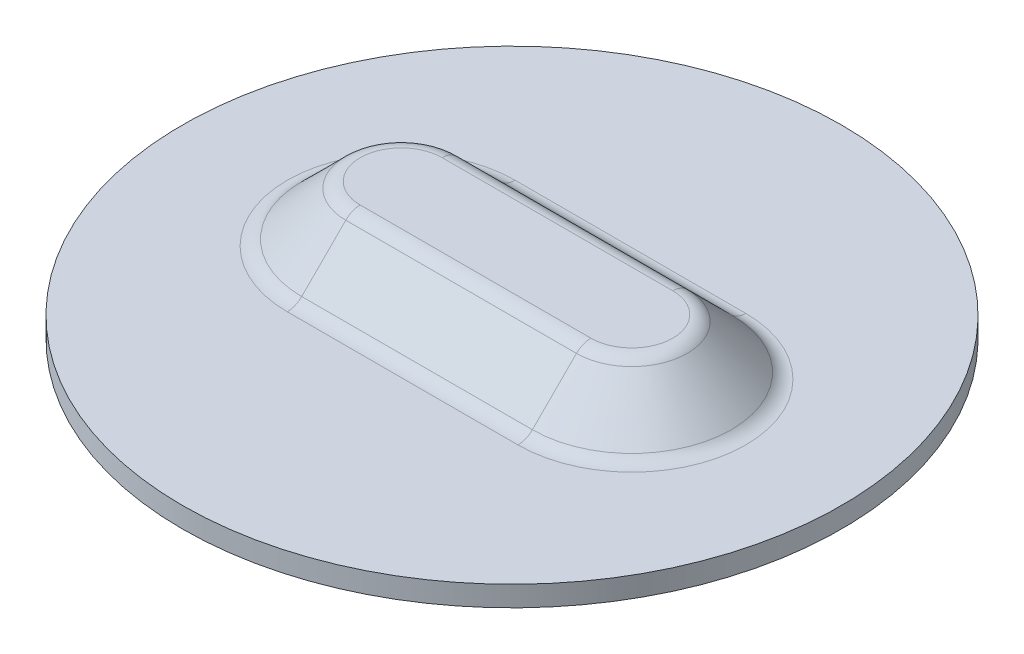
ISO-10303-21;
HEADER;
FILE_DESCRIPTION(('STEP AP214'),'2;1');
FILE_NAME('part.step','',(''),(''),'','','');
FILE_SCHEMA(('AUTOMOTIVE_DESIGN { 1 0 10303 214 1 1 1 1 }'));
ENDSEC;
DATA;
#1=APPLICATION_CONTEXT('core data for automotive mechanical design processes');
#2=APPLICATION_PROTOCOL_DEFINITION('international standard','automotive_design',2000,#1);
#3=PRODUCT_CONTEXT('',#1,'mechanical');
#4=PRODUCT('Part','Part','',(#3));
#5=PRODUCT_RELATED_PRODUCT_CATEGORY('part','',(#4));
#6=PRODUCT_DEFINITION_FORMATION('','',#4);
#7=PRODUCT_DEFINITION_CONTEXT('part definition',#1,'design');
#8=PRODUCT_DEFINITION('design','',#6,#7);
#9=PRODUCT_DEFINITION_SHAPE('','',#8);
#10=(LENGTH_UNIT() NAMED_UNIT(*) SI_UNIT(.MILLI.,.METRE.));
#11=(NAMED_UNIT(*) PLANE_ANGLE_UNIT() SI_UNIT($,.RADIAN.));
#12=(NAMED_UNIT(*) SI_UNIT($,.STERADIAN.) SOLID_ANGLE_UNIT());
#13=UNCERTAINTY_MEASURE_WITH_UNIT(LENGTH_MEASURE(1.E-05),#10,'distance_accuracy_value','');
#14=(GEOMETRIC_REPRESENTATION_CONTEXT(3) GLOBAL_UNCERTAINTY_ASSIGNED_CONTEXT((#13)) GLOBAL_UNIT_ASSIGNED_CONTEXT((#10,
#11,#12)) REPRESENTATION_CONTEXT('',''));
#15=CARTESIAN_POINT('',(0.,0.,0.));
#16=DIRECTION('',(0.,0.,1.));
#17=DIRECTION('',(1.,0.,0.));
#18=AXIS2_PLACEMENT_3D('',#15,#16,#17);
#19=CARTESIAN_POINT('',(-8.89,0.,-0.348010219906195));
#20=DIRECTION('',(0.,1.,0.));
#21=DIRECTION('',(0.,0.,1.));
#22=AXIS2_PLACEMENT_3D('',#19,#20,#21);
#23=PLANE('',#22);
#24=CARTESIAN_POINT('',(8.89,0.,-0.348010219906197));
#25=DIRECTION('',(0.,-1.,0.));
#26=DIRECTION('',(0.,0.,-1.));
#27=AXIS2_PLACEMENT_3D('',#24,#25,#26);
#28=CIRCLE('',#27,3.15769648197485);
#29=CARTESIAN_POINT('',(8.89,0.,-3.50570670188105));
#30=VERTEX_POINT('',#29);
#31=CARTESIAN_POINT('',(8.89,0.,2.80968626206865));
#32=VERTEX_POINT('',#31);
#33=EDGE_CURVE('E306',#30,#32,#28,.T.);
#34=ORIENTED_EDGE('',*,*,#33,.F.);
#35=DIRECTION('',(-1.,0.,0.));
#36=VECTOR('',#35,1.);
#37=CARTESIAN_POINT('',(-8.89,0.,-3.50570670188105));
#38=LINE('',#37,#36);
#39=CARTESIAN_POINT('',(-8.89,0.,-3.50570670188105));
#40=VERTEX_POINT('',#39);
#41=EDGE_CURVE('E292',#40,#30,#38,.F.);
#42=ORIENTED_EDGE('',*,*,#41,.F.);
#43=CARTESIAN_POINT('',(-8.89,0.,-0.348010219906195));
#44=DIRECTION('',(0.,-1.,0.));
#45=DIRECTION('',(0.,0.,1.));
#46=AXIS2_PLACEMENT_3D('',#43,#44,#45);
#47=CIRCLE('',#46,3.15769648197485);
#48=CARTESIAN_POINT('',(-8.89,0.,2.80968626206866));
#49=VERTEX_POINT('',#48);
#50=EDGE_CURVE('E259',#49,#40,#47,.T.);
#51=ORIENTED_EDGE('',*,*,#50,.F.);
#52=DIRECTION('',(1.,0.,0.));
#53=VECTOR('',#52,1.);
#54=CARTESIAN_POINT('',(-8.89,0.,2.80968626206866));
#55=LINE('',#54,#53);
#56=EDGE_CURVE('E264',#32,#49,#55,.F.);
#57=ORIENTED_EDGE('',*,*,#56,.F.);
#58=EDGE_LOOP('',(#34,#42,#51,#57));
#59=FACE_BOUND('',#58,.T.);
#60=ADVANCED_FACE('F18',(#59),#23,.T.);
#61=CARTESIAN_POINT('',(8.89,-1.5748,-0.348010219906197));
#62=DIRECTION('',(0.,1.,0.));
#63=DIRECTION('',(0.,0.,1.));
#64=AXIS2_PLACEMENT_3D('',#61,#62,#63);
#65=TOROIDAL_SURFACE('',#64,3.15769648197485,1.5748);
#66=CARTESIAN_POINT('',(8.89,-1.5748,2.80968626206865));
#67=DIRECTION('',(1.,0.,0.));
#68=DIRECTION('',(0.,0.,-1.));
#69=AXIS2_PLACEMENT_3D('',#66,#67,#68);
#70=CIRCLE('',#69,1.5748);
#71=CARTESIAN_POINT('',(8.89,-0.461248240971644,3.92323802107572));
#72=VERTEX_POINT('',#71);
#73=EDGE_CURVE('E258',#72,#32,#70,.F.);
#74=ORIENTED_EDGE('',*,*,#73,.F.);
#75=CARTESIAN_POINT('',(8.89,-0.461248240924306,-0.348010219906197));
#76=DIRECTION('',(0.,-1.,0.));
#77=DIRECTION('',(0.,0.,1.));
#78=AXIS2_PLACEMENT_3D('',#75,#76,#77);
#79=CIRCLE('',#78,4.2712482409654);
#80=CARTESIAN_POINT('',(8.89,-0.461248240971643,-4.61925846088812));
#81=VERTEX_POINT('',#80);
#82=EDGE_CURVE('E244',#81,#72,#79,.T.);
#83=ORIENTED_EDGE('',*,*,#82,.F.);
#84=CARTESIAN_POINT('',(8.89,-1.5748,-3.50570670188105));
#85=DIRECTION('',(-1.,0.,0.));
#86=DIRECTION('',(0.,0.,1.));
#87=AXIS2_PLACEMENT_3D('',#84,#85,#86);
#88=CIRCLE('',#87,1.5748);
#89=EDGE_CURVE('E300',#30,#81,#88,.T.);
#90=ORIENTED_EDGE('',*,*,#89,.F.);
#91=ORIENTED_EDGE('',*,*,#33,.T.);
#92=EDGE_LOOP('',(#74,#83,#90,#91));
#93=FACE_BOUND('',#92,.T.);
#94=ADVANCED_FACE('F311',(#93),#65,.T.);
#95=CARTESIAN_POINT('',(-8.89,-1.5748,-3.50570670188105));
#96=DIRECTION('',(-1.,0.,0.));
#97=DIRECTION('',(0.,0.,1.));
#98=AXIS2_PLACEMENT_3D('',#95,#96,#97);
#99=CYLINDRICAL_SURFACE('',#98,1.5748);
#100=CARTESIAN_POINT('',(-8.89,-1.5748,-3.50570670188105));
#101=DIRECTION('',(-1.,0.,0.));
#102=DIRECTION('',(0.,0.,-1.));
#103=AXIS2_PLACEMENT_3D('',#100,#101,#102);
#104=CIRCLE('',#103,1.5748);
#105=CARTESIAN_POINT('',(-8.89,-0.461248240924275,-4.6192584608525));
#106=VERTEX_POINT('',#105);
#107=EDGE_CURVE('E273',#40,#106,#104,.T.);
#108=ORIENTED_EDGE('',*,*,#107,.F.);
#109=ORIENTED_EDGE('',*,*,#41,.T.);
#110=ORIENTED_EDGE('',*,*,#89,.T.);
#111=DIRECTION('',(1.,0.,0.));
#112=VECTOR('',#111,1.);
#113=CARTESIAN_POINT('',(-8.89,-0.461248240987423,-4.61925846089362));
#114=LINE('',#113,#112);
#115=EDGE_CURVE('E238',#106,#81,#114,.T.);
#116=ORIENTED_EDGE('',*,*,#115,.F.);
#117=EDGE_LOOP('',(#108,#109,#110,#116));
#118=FACE_BOUND('',#117,.T.);
#119=ADVANCED_FACE('F282',(#118),#99,.T.);
#120=CARTESIAN_POINT('',(-8.89,-1.5748,-0.348010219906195));
#121=DIRECTION('',(0.,1.,0.));
#122=DIRECTION('',(0.,0.,1.));
#123=AXIS2_PLACEMENT_3D('',#120,#121,#122);
#124=TOROIDAL_SURFACE('',#123,3.15769648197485,1.5748);
#125=CARTESIAN_POINT('',(-8.89,-1.5748,2.80968626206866));
#126=DIRECTION('',(1.,0.,0.));
#127=DIRECTION('',(0.,0.,-1.));
#128=AXIS2_PLACEMENT_3D('',#125,#126,#127);
#129=CIRCLE('',#128,1.5748);
#130=CARTESIAN_POINT('',(-8.89,-0.461248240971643,3.92323802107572));
#131=VERTEX_POINT('',#130);
#132=EDGE_CURVE('E255',#49,#131,#129,.T.);
#133=ORIENTED_EDGE('',*,*,#132,.F.);
#134=ORIENTED_EDGE('',*,*,#50,.T.);
#135=ORIENTED_EDGE('',*,*,#107,.T.);
#136=CARTESIAN_POINT('',(-8.89,-0.461248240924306,-0.348010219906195));
#137=DIRECTION('',(0.,-1.,0.));
#138=DIRECTION('',(0.,0.,1.));
#139=AXIS2_PLACEMENT_3D('',#136,#137,#138);
#140=CIRCLE('',#139,4.2712482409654);
#141=EDGE_CURVE('E222',#131,#106,#140,.T.);
#142=ORIENTED_EDGE('',*,*,#141,.F.);
#143=EDGE_LOOP('',(#133,#134,#135,#142));
#144=FACE_BOUND('',#143,.T.);
#145=ADVANCED_FACE('F276',(#144),#124,.T.);
#146=CARTESIAN_POINT('',(-8.89,-1.5748,2.80968626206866));
#147=DIRECTION('',(1.,0.,0.));
#148=DIRECTION('',(0.,0.,-1.));
#149=AXIS2_PLACEMENT_3D('',#146,#147,#148);
#150=CYLINDRICAL_SURFACE('',#149,1.5748);
#151=ORIENTED_EDGE('',*,*,#73,.T.);
#152=ORIENTED_EDGE('',*,*,#56,.T.);
#153=ORIENTED_EDGE('',*,*,#132,.T.);
#154=DIRECTION('',(1.,0.,0.));
#155=VECTOR('',#154,1.);
#156=CARTESIAN_POINT('',(-8.89,-0.461248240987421,3.92323802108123));
#157=LINE('',#156,#155);
#158=EDGE_CURVE('E221',#72,#131,#157,.F.);
#159=ORIENTED_EDGE('',*,*,#158,.F.);
#160=EDGE_LOOP('',(#151,#152,#153,#159));
#161=FACE_BOUND('',#160,.T.);
#162=ADVANCED_FACE('F281',(#161),#150,.T.);
#163=CARTESIAN_POINT('',(8.89,-3.85675175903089,-0.348010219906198));
#164=DIRECTION('',(0.,-1.,0.));
#165=DIRECTION('',(1.,0.,0.));
#166=AXIS2_PLACEMENT_3D('',#163,#164,#165);
#167=CONICAL_SURFACE('',#166,7.66675175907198,0.785398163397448);
#168=DIRECTION('',(0.,0.707106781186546,0.707106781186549));
#169=VECTOR('',#168,1.);
#170=CARTESIAN_POINT('',(8.89,0.,-4.1580102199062));
#171=LINE('',#170,#169);
#172=CARTESIAN_POINT('',(8.89,-3.85675175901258,-8.01476197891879));
#173=VERTEX_POINT('',#172);
#174=EDGE_CURVE('E241',#81,#173,#171,.F.);
#175=ORIENTED_EDGE('',*,*,#174,.F.);
#176=ORIENTED_EDGE('',*,*,#82,.T.);
#177=DIRECTION('',(0.,-0.707106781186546,0.707106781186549));
#178=VECTOR('',#177,1.);
#179=CARTESIAN_POINT('',(8.89,0.,3.46198978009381));
#180=LINE('',#179,#178);
#181=CARTESIAN_POINT('',(8.89,-3.85675175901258,7.3187415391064));
#182=VERTEX_POINT('',#181);
#183=EDGE_CURVE('E218',#182,#72,#180,.F.);
#184=ORIENTED_EDGE('',*,*,#183,.F.);
#185=CARTESIAN_POINT('',(8.89,-3.85675175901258,-0.348010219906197));
#186=DIRECTION('',(0.,-1.,0.));
#187=DIRECTION('',(0.,0.,-1.));
#188=AXIS2_PLACEMENT_3D('',#185,#186,#187);
#189=CIRCLE('',#188,7.66675175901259);
#190=EDGE_CURVE('E209',#182,#173,#189,.F.);
#191=ORIENTED_EDGE('',*,*,#190,.T.);
#192=EDGE_LOOP('',(#175,#176,#184,#191));
#193=FACE_BOUND('',#192,.T.);
#194=ADVANCED_FACE('F648',(#193),#167,.T.);
#195=CARTESIAN_POINT('',(-8.89,0.,-4.1580102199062));
#196=DIRECTION('',(0.,0.707106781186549,-0.707106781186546));
#197=DIRECTION('',(0.,0.707106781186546,0.707106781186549));
#198=AXIS2_PLACEMENT_3D('',#195,#196,#197);
#199=PLANE('',#198);
#200=DIRECTION('',(0.,0.707106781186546,0.707106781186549));
#201=VECTOR('',#200,1.);
#202=CARTESIAN_POINT('',(-8.89000000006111,-498996.538010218,-499000.69602044));
#203=LINE('',#202,#201);
#204=CARTESIAN_POINT('',(-8.89,-3.85675175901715,-8.01476197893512));
#205=VERTEX_POINT('',#204);
#206=EDGE_CURVE('E235',#106,#205,#203,.F.);
#207=ORIENTED_EDGE('',*,*,#206,.F.);
#208=ORIENTED_EDGE('',*,*,#115,.T.);
#209=ORIENTED_EDGE('',*,*,#174,.T.);
#210=DIRECTION('',(-1.,0.,0.));
#211=VECTOR('',#210,1.);
#212=CARTESIAN_POINT('',(-8.89,-3.85675175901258,-8.01476197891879));
#213=LINE('',#212,#211);
#214=EDGE_CURVE('E189',#173,#205,#213,.T.);
#215=ORIENTED_EDGE('',*,*,#214,.T.);
#216=EDGE_LOOP('',(#207,#208,#209,#215));
#217=FACE_BOUND('',#216,.T.);
#218=ADVANCED_FACE('F639',(#217),#199,.T.);
#219=CARTESIAN_POINT('',(-8.89,-3.85675175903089,-0.348010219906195));
#220=DIRECTION('',(0.,-1.,0.));
#221=DIRECTION('',(1.,0.,0.));
#222=AXIS2_PLACEMENT_3D('',#219,#220,#221);
#223=CONICAL_SURFACE('',#222,7.66675175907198,0.785398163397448);
#224=DIRECTION('',(0.,-0.707106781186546,0.707106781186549));
#225=VECTOR('',#224,1.);
#226=CARTESIAN_POINT('',(-8.89,0.,3.46198978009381));
#227=LINE('',#226,#225);
#228=CARTESIAN_POINT('',(-8.89,-3.85675175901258,7.3187415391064));
#229=VERTEX_POINT('',#228);
#230=EDGE_CURVE('E211',#131,#229,#227,.T.);
#231=ORIENTED_EDGE('',*,*,#230,.F.);
#232=ORIENTED_EDGE('',*,*,#141,.T.);
#233=ORIENTED_EDGE('',*,*,#206,.T.);
#234=CARTESIAN_POINT('',(-8.89,-3.85675175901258,-0.348010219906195));
#235=DIRECTION('',(0.,-1.,0.));
#236=DIRECTION('',(0.,0.,-1.));
#237=AXIS2_PLACEMENT_3D('',#234,#235,#236);
#238=CIRCLE('',#237,7.66675175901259);
#239=EDGE_CURVE('E183',#205,#229,#238,.F.);
#240=ORIENTED_EDGE('',*,*,#239,.T.);
#241=EDGE_LOOP('',(#231,#232,#233,#240));
#242=FACE_BOUND('',#241,.T.);
#243=ADVANCED_FACE('F631',(#242),#223,.T.);
#244=CARTESIAN_POINT('',(-8.89,0.,3.46198978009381));
#245=DIRECTION('',(0.,0.707106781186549,0.707106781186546));
#246=DIRECTION('',(0.,-0.707106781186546,0.707106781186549));
#247=AXIS2_PLACEMENT_3D('',#244,#245,#246);
#248=PLANE('',#247);
#249=ORIENTED_EDGE('',*,*,#230,.T.);
#250=DIRECTION('',(1.,0.,0.));
#251=VECTOR('',#250,1.);
#252=CARTESIAN_POINT('',(-8.89,-3.85675175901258,7.3187415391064));
#253=LINE('',#252,#251);
#254=EDGE_CURVE('E152',#229,#182,#253,.T.);
#255=ORIENTED_EDGE('',*,*,#254,.T.);
#256=ORIENTED_EDGE('',*,*,#183,.T.);
#257=ORIENTED_EDGE('',*,*,#158,.T.);
#258=EDGE_LOOP('',(#249,#255,#256,#257));
#259=FACE_BOUND('',#258,.T.);
#260=ADVANCED_FACE('F624',(#259),#248,.T.);
#261=CARTESIAN_POINT('',(-8.89,-1.5748,-0.348010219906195));
#262=DIRECTION('',(0.,1.,0.));
#263=DIRECTION('',(0.,0.,1.));
#264=AXIS2_PLACEMENT_3D('',#261,#262,#263);
#265=PLANE('',#264);
#266=DIRECTION('',(1.,0.,0.));
#267=VECTOR('',#266,1.);
#268=CARTESIAN_POINT('',(-8.89,-1.5748,-3.50570670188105));
#269=LINE('',#268,#267);
#270=CARTESIAN_POINT('',(-8.89,-1.57480000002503,-3.50570670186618));
#271=VERTEX_POINT('',#270);
#272=CARTESIAN_POINT('',(8.89,-1.57480000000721,-3.50570670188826));
#273=VERTEX_POINT('',#272);
#274=EDGE_CURVE('E117',#271,#273,#269,.T.);
#275=ORIENTED_EDGE('',*,*,#274,.T.);
#276=CARTESIAN_POINT('',(8.89,-1.57480000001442,-0.348010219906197));
#277=DIRECTION('',(0.,-1.,0.));
#278=DIRECTION('',(0.,0.,-1.));
#279=AXIS2_PLACEMENT_3D('',#276,#277,#278);
#280=CIRCLE('',#279,3.15769648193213);
#281=CARTESIAN_POINT('',(8.89,-1.57480000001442,2.80968626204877));
#282=VERTEX_POINT('',#281);
#283=EDGE_CURVE('E22',#273,#282,#280,.T.);
#284=ORIENTED_EDGE('',*,*,#283,.T.);
#285=DIRECTION('',(1.,0.,0.));
#286=VECTOR('',#285,1.);
#287=CARTESIAN_POINT('',(-8.89,-1.5748,2.80968626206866));
#288=LINE('',#287,#286);
#289=CARTESIAN_POINT('',(-8.89,-1.57480000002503,2.80968626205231));
#290=VERTEX_POINT('',#289);
#291=EDGE_CURVE('E121',#282,#290,#288,.F.);
#292=ORIENTED_EDGE('',*,*,#291,.T.);
#293=CARTESIAN_POINT('',(-8.89,-1.57480000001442,-0.348010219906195));
#294=DIRECTION('',(0.,-1.,0.));
#295=DIRECTION('',(0.,0.,-1.));
#296=AXIS2_PLACEMENT_3D('',#293,#294,#295);
#297=CIRCLE('',#296,3.15769648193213);
#298=EDGE_CURVE('E503',#290,#271,#297,.T.);
#299=ORIENTED_EDGE('',*,*,#298,.T.);
#300=EDGE_LOOP('',(#275,#284,#292,#299));
#301=FACE_BOUND('',#300,.T.);
#302=ADVANCED_FACE('F120',(#301),#265,.F.);
#303=CARTESIAN_POINT('',(8.89,-2.7432,-0.348010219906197));
#304=DIRECTION('',(0.,-1.,0.));
#305=DIRECTION('',(0.,0.,-1.));
#306=AXIS2_PLACEMENT_3D('',#303,#304,#305);
#307=TOROIDAL_SURFACE('',#306,8.78030351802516,1.5748);
#308=CARTESIAN_POINT('',(8.89,-4.318,-0.348010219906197));
#309=DIRECTION('',(0.,1.,0.));
#310=DIRECTION('',(0.,0.,1.));
#311=AXIS2_PLACEMENT_3D('',#308,#309,#310);
#312=CIRCLE('',#311,8.78030351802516);
#313=CARTESIAN_POINT('',(8.89,-4.318,8.43229329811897));
#314=VERTEX_POINT('',#313);
#315=CARTESIAN_POINT('',(8.89,-4.318,-9.12831373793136));
#316=VERTEX_POINT('',#315);
#317=EDGE_CURVE('E458',#314,#316,#312,.T.);
#318=ORIENTED_EDGE('',*,*,#317,.T.);
#319=CARTESIAN_POINT('',(8.89,-2.7432,-9.12831373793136));
#320=DIRECTION('',(-1.,0.,0.));
#321=DIRECTION('',(0.,0.,1.));
#322=AXIS2_PLACEMENT_3D('',#319,#320,#321);
#323=CIRCLE('',#322,1.5748);
#324=EDGE_CURVE('E186',#316,#173,#323,.T.);
#325=ORIENTED_EDGE('',*,*,#324,.T.);
#326=ORIENTED_EDGE('',*,*,#190,.F.);
#327=CARTESIAN_POINT('',(8.89,-2.7432,8.43229329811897));
#328=DIRECTION('',(1.,0.,0.));
#329=DIRECTION('',(0.,0.,-1.));
#330=AXIS2_PLACEMENT_3D('',#327,#328,#329);
#331=CIRCLE('',#330,1.5748);
#332=EDGE_CURVE('E133',#182,#314,#331,.F.);
#333=ORIENTED_EDGE('',*,*,#332,.T.);
#334=EDGE_LOOP('',(#318,#325,#326,#333));
#335=FACE_BOUND('',#334,.T.);
#336=ADVANCED_FACE('F195',(#335),#307,.F.);
#337=CARTESIAN_POINT('',(-8.89,-2.7432,-9.12831373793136));
#338=DIRECTION('',(-1.,0.,0.));
#339=DIRECTION('',(0.,0.,1.));
#340=AXIS2_PLACEMENT_3D('',#337,#338,#339);
#341=CYLINDRICAL_SURFACE('',#340,1.5748);
#342=DIRECTION('',(1.,0.,0.));
#343=VECTOR('',#342,1.);
#344=CARTESIAN_POINT('',(0.,-4.318,-9.12831373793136));
#345=LINE('',#344,#343);
#346=CARTESIAN_POINT('',(-8.89,-4.318,-9.12831373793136));
#347=VERTEX_POINT('',#346);
#348=EDGE_CURVE('E491',#316,#347,#345,.F.);
#349=ORIENTED_EDGE('',*,*,#348,.T.);
#350=CARTESIAN_POINT('',(-8.89,-2.7432,-9.12831373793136));
#351=DIRECTION('',(1.,0.,0.));
#352=DIRECTION('',(0.,0.,-1.));
#353=AXIS2_PLACEMENT_3D('',#350,#351,#352);
#354=CIRCLE('',#353,1.5748);
#355=EDGE_CURVE('E153',#347,#205,#354,.F.);
#356=ORIENTED_EDGE('',*,*,#355,.T.);
#357=ORIENTED_EDGE('',*,*,#214,.F.);
#358=ORIENTED_EDGE('',*,*,#324,.F.);
#359=EDGE_LOOP('',(#349,#356,#357,#358));
#360=FACE_BOUND('',#359,.T.);
#361=ADVANCED_FACE('F169',(#360),#341,.F.);
#362=CARTESIAN_POINT('',(-8.89,-2.7432,-0.348010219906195));
#363=DIRECTION('',(0.,-1.,0.));
#364=DIRECTION('',(0.,0.,-1.));
#365=AXIS2_PLACEMENT_3D('',#362,#363,#364);
#366=TOROIDAL_SURFACE('',#365,8.78030351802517,1.5748);
#367=CARTESIAN_POINT('',(-8.89,-4.318,-0.348010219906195));
#368=DIRECTION('',(0.,1.,0.));
#369=DIRECTION('',(0.,0.,-1.));
#370=AXIS2_PLACEMENT_3D('',#367,#368,#369);
#371=CIRCLE('',#370,8.78030351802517);
#372=CARTESIAN_POINT('',(-8.89,-4.318,8.43229329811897));
#373=VERTEX_POINT('',#372);
#374=EDGE_CURVE('E488',#347,#373,#371,.T.);
#375=ORIENTED_EDGE('',*,*,#374,.T.);
#376=CARTESIAN_POINT('',(-8.89,-2.7432,8.43229329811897));
#377=DIRECTION('',(1.,0.,0.));
#378=DIRECTION('',(0.,0.,-1.));
#379=AXIS2_PLACEMENT_3D('',#376,#377,#378);
#380=CIRCLE('',#379,1.5748);
#381=EDGE_CURVE('E149',#373,#229,#380,.T.);
#382=ORIENTED_EDGE('',*,*,#381,.T.);
#383=ORIENTED_EDGE('',*,*,#239,.F.);
#384=ORIENTED_EDGE('',*,*,#355,.F.);
#385=EDGE_LOOP('',(#375,#382,#383,#384));
#386=FACE_BOUND('',#385,.T.);
#387=ADVANCED_FACE('F163',(#386),#366,.F.);
#388=CARTESIAN_POINT('',(-8.89,-2.7432,8.43229329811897));
#389=DIRECTION('',(1.,0.,0.));
#390=DIRECTION('',(0.,0.,-1.));
#391=AXIS2_PLACEMENT_3D('',#388,#389,#390);
#392=CYLINDRICAL_SURFACE('',#391,1.5748);
#393=ORIENTED_EDGE('',*,*,#254,.F.);
#394=ORIENTED_EDGE('',*,*,#381,.F.);
#395=DIRECTION('',(1.,0.,0.));
#396=VECTOR('',#395,1.);
#397=CARTESIAN_POINT('',(0.,-4.318,8.43229329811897));
#398=LINE('',#397,#396);
#399=EDGE_CURVE('E480',#373,#314,#398,.T.);
#400=ORIENTED_EDGE('',*,*,#399,.T.);
#401=ORIENTED_EDGE('',*,*,#332,.F.);
#402=EDGE_LOOP('',(#393,#394,#400,#401));
#403=FACE_BOUND('',#402,.T.);
#404=ADVANCED_FACE('F168',(#403),#392,.F.);
#405=CARTESIAN_POINT('',(-8.89,-1.11355175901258,2.34843802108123));
#406=DIRECTION('',(0.,0.707106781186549,0.707106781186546));
#407=DIRECTION('',(0.,-0.707106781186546,0.707106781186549));
#408=AXIS2_PLACEMENT_3D('',#405,#406,#407);
#409=PLANE('',#408);
#410=DIRECTION('',(1.,0.,0.));
#411=VECTOR('',#410,1.);
#412=CARTESIAN_POINT('',(-8.89,-4.97030351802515,6.20518978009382));
#413=LINE('',#412,#411);
#414=CARTESIAN_POINT('',(-8.89,-4.97030351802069,6.20518978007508));
#415=VERTEX_POINT('',#414);
#416=CARTESIAN_POINT('',(8.89,-4.97030351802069,6.20518978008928));
#417=VERTEX_POINT('',#416);
#418=EDGE_CURVE('E450',#415,#417,#413,.T.);
#419=ORIENTED_EDGE('',*,*,#418,.F.);
#420=DIRECTION('',(0.,0.707106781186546,-0.707106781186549));
#421=VECTOR('',#420,1.);
#422=CARTESIAN_POINT('',(-8.89,-498998.765113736,499000.));
#423=LINE('',#422,#421);
#424=EDGE_CURVE('E131',#415,#290,#423,.T.);
#425=ORIENTED_EDGE('',*,*,#424,.T.);
#426=ORIENTED_EDGE('',*,*,#291,.F.);
#427=DIRECTION('',(0.,0.707106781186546,-0.707106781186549));
#428=VECTOR('',#427,1.);
#429=CARTESIAN_POINT('',(8.89,-498998.765113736,499000.));
#430=LINE('',#429,#428);
#431=EDGE_CURVE('E126',#282,#417,#430,.F.);
#432=ORIENTED_EDGE('',*,*,#431,.T.);
#433=EDGE_LOOP('',(#419,#425,#426,#432));
#434=FACE_BOUND('',#433,.T.);
#435=ADVANCED_FACE('F128',(#434),#409,.F.);
#436=CARTESIAN_POINT('',(8.89,-4.97030351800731,-0.348010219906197));
#437=DIRECTION('',(0.,-1.,0.));
#438=DIRECTION('',(0.,0.,-1.));
#439=AXIS2_PLACEMENT_3D('',#436,#437,#438);
#440=CONICAL_SURFACE('',#439,6.55319999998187,0.785398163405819);
#441=ORIENTED_EDGE('',*,*,#283,.F.);
#442=DIRECTION('',(0.,0.707106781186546,0.707106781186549));
#443=VECTOR('',#442,1.);
#444=CARTESIAN_POINT('',(8.89,-1.11355175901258,-3.04445846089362));
#445=LINE('',#444,#443);
#446=CARTESIAN_POINT('',(8.89,-4.97030351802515,-6.90121021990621));
#447=VERTEX_POINT('',#446);
#448=EDGE_CURVE('E141',#273,#447,#445,.F.);
#449=ORIENTED_EDGE('',*,*,#448,.T.);
#450=CARTESIAN_POINT('',(8.89,-4.97030351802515,-0.348010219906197));
#451=DIRECTION('',(0.,-1.,0.));
#452=DIRECTION('',(0.,0.,-1.));
#453=AXIS2_PLACEMENT_3D('',#450,#451,#452);
#454=CIRCLE('',#453,6.55320000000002);
#455=EDGE_CURVE('E138',#417,#447,#454,.F.);
#456=ORIENTED_EDGE('',*,*,#455,.F.);
#457=ORIENTED_EDGE('',*,*,#431,.F.);
#458=EDGE_LOOP('',(#441,#449,#456,#457));
#459=FACE_BOUND('',#458,.T.);
#460=ADVANCED_FACE('F136',(#459),#440,.F.);
#461=CARTESIAN_POINT('',(-8.89,-1.11355175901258,-3.04445846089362));
#462=DIRECTION('',(0.,0.707106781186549,-0.707106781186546));
#463=DIRECTION('',(0.,0.707106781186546,0.707106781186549));
#464=AXIS2_PLACEMENT_3D('',#461,#462,#463);
#465=PLANE('',#464);
#466=ORIENTED_EDGE('',*,*,#274,.F.);
#467=DIRECTION('',(0.,0.707106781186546,0.707106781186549));
#468=VECTOR('',#467,1.);
#469=CARTESIAN_POINT('',(-8.89000000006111,-498998.765113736,-499000.69602044));
#470=LINE('',#469,#468);
#471=CARTESIAN_POINT('',(-8.89,-4.97030351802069,-6.90121021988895));
#472=VERTEX_POINT('',#471);
#473=EDGE_CURVE('E506',#271,#472,#470,.F.);
#474=ORIENTED_EDGE('',*,*,#473,.T.);
#475=DIRECTION('',(-1.,0.,0.));
#476=VECTOR('',#475,1.);
#477=CARTESIAN_POINT('',(-8.89,-4.97030351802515,-6.90121021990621));
#478=LINE('',#477,#476);
#479=EDGE_CURVE('E421',#447,#472,#478,.T.);
#480=ORIENTED_EDGE('',*,*,#479,.F.);
#481=ORIENTED_EDGE('',*,*,#448,.F.);
#482=EDGE_LOOP('',(#466,#474,#480,#481));
#483=FACE_BOUND('',#482,.T.);
#484=ADVANCED_FACE('F517',(#483),#465,.F.);
#485=CARTESIAN_POINT('',(-8.89,-4.97030351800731,-0.348010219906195));
#486=DIRECTION('',(0.,-1.,0.));
#487=DIRECTION('',(0.,0.,-1.));
#488=AXIS2_PLACEMENT_3D('',#485,#486,#487);
#489=CONICAL_SURFACE('',#488,6.55319999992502,0.785398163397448);
#490=ORIENTED_EDGE('',*,*,#298,.F.);
#491=ORIENTED_EDGE('',*,*,#424,.F.);
#492=CARTESIAN_POINT('',(-8.89,-4.97030351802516,-0.348010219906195));
#493=DIRECTION('',(0.,-1.,0.));
#494=DIRECTION('',(0.,0.,-1.));
#495=AXIS2_PLACEMENT_3D('',#492,#493,#494);
#496=CIRCLE('',#495,6.55320000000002);
#497=EDGE_CURVE('E417',#472,#415,#496,.F.);
#498=ORIENTED_EDGE('',*,*,#497,.F.);
#499=ORIENTED_EDGE('',*,*,#473,.F.);
#500=EDGE_LOOP('',(#490,#491,#498,#499));
#501=FACE_BOUND('',#500,.T.);
#502=ADVANCED_FACE('F473',(#501),#489,.F.);
#503=CARTESIAN_POINT('',(0.,-4.318,0.));
#504=DIRECTION('',(0.,-1.,0.));
#505=DIRECTION('',(0.,0.,-1.));
#506=AXIS2_PLACEMENT_3D('',#503,#504,#505);
#507=PLANE('',#506);
#508=CARTESIAN_POINT('',(0.,-4.318,0.));
#509=DIRECTION('',(0.,-1.,0.));
#510=DIRECTION('',(0.,0.,-1.));
#511=AXIS2_PLACEMENT_3D('',#508,#509,#510);
#512=CIRCLE('',#511,25.4);
#513=CARTESIAN_POINT('',(0.,-4.318,-25.4));
#514=VERTEX_POINT('',#513);
#515=EDGE_CURVE('E397',#514,#514,#512,.T.);
#516=ORIENTED_EDGE('',*,*,#515,.F.);
#517=EDGE_LOOP('',(#516));
#518=FACE_BOUND('',#517,.T.);
#519=ORIENTED_EDGE('',*,*,#374,.F.);
#520=ORIENTED_EDGE('',*,*,#348,.F.);
#521=ORIENTED_EDGE('',*,*,#317,.F.);
#522=ORIENTED_EDGE('',*,*,#399,.F.);
#523=EDGE_LOOP('',(#519,#520,#521,#522));
#524=FACE_BOUND('',#523,.T.);
#525=ADVANCED_FACE('F464',(#518,#524),#507,.F.);
#526=CARTESIAN_POINT('',(-8.89,-2.7432,8.43229329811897));
#527=DIRECTION('',(1.,0.,0.));
#528=DIRECTION('',(0.,0.,-1.));
#529=AXIS2_PLACEMENT_3D('',#526,#527,#528);
#530=CYLINDRICAL_SURFACE('',#529,3.1496);
#531=CARTESIAN_POINT('',(-8.89,-2.7432,8.43229329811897));
#532=DIRECTION('',(-1.,0.,0.));
#533=DIRECTION('',(0.,0.,1.));
#534=AXIS2_PLACEMENT_3D('',#531,#532,#533);
#535=CIRCLE('',#534,3.1496);
#536=CARTESIAN_POINT('',(-8.89,-5.8928,8.43229329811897));
#537=VERTEX_POINT('',#536);
#538=EDGE_CURVE('E410',#415,#537,#535,.T.);
#539=ORIENTED_EDGE('',*,*,#538,.F.);
#540=ORIENTED_EDGE('',*,*,#418,.T.);
#541=CARTESIAN_POINT('',(8.89,-2.7432,8.43229329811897));
#542=DIRECTION('',(-1.,0.,0.));
#543=DIRECTION('',(0.,0.,1.));
#544=AXIS2_PLACEMENT_3D('',#541,#542,#543);
#545=CIRCLE('',#544,3.1496);
#546=CARTESIAN_POINT('',(8.89,-5.8928,8.43229329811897));
#547=VERTEX_POINT('',#546);
#548=EDGE_CURVE('E443',#547,#417,#545,.F.);
#549=ORIENTED_EDGE('',*,*,#548,.F.);
#550=DIRECTION('',(1.,0.,0.));
#551=VECTOR('',#550,1.);
#552=CARTESIAN_POINT('',(0.,-5.8928,8.43229329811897));
#553=LINE('',#552,#551);
#554=EDGE_CURVE('E387',#537,#547,#553,.T.);
#555=ORIENTED_EDGE('',*,*,#554,.F.);
#556=EDGE_LOOP('',(#539,#540,#549,#555));
#557=FACE_BOUND('',#556,.T.);
#558=ADVANCED_FACE('F437',(#557),#530,.T.);
#559=CARTESIAN_POINT('',(8.89,-2.7432,-0.348010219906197));
#560=DIRECTION('',(0.,-1.,0.));
#561=DIRECTION('',(0.,0.,-1.));
#562=AXIS2_PLACEMENT_3D('',#559,#560,#561);
#563=TOROIDAL_SURFACE('',#562,8.78030351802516,3.1496);
#564=CARTESIAN_POINT('',(8.89,-2.7432,-9.12831373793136));
#565=DIRECTION('',(-1.,0.,0.));
#566=DIRECTION('',(0.,0.,1.));
#567=AXIS2_PLACEMENT_3D('',#564,#565,#566);
#568=CIRCLE('',#567,3.1496);
#569=CARTESIAN_POINT('',(8.89,-5.8928,-9.12831373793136));
#570=VERTEX_POINT('',#569);
#571=EDGE_CURVE('E424',#570,#447,#568,.T.);
#572=ORIENTED_EDGE('',*,*,#571,.F.);
#573=CARTESIAN_POINT('',(8.89,-5.8928,-0.348010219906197));
#574=DIRECTION('',(0.,-1.,0.));
#575=DIRECTION('',(0.,0.,-1.));
#576=AXIS2_PLACEMENT_3D('',#573,#574,#575);
#577=CIRCLE('',#576,8.78030351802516);
#578=EDGE_CURVE('E392',#547,#570,#577,.F.);
#579=ORIENTED_EDGE('',*,*,#578,.F.);
#580=ORIENTED_EDGE('',*,*,#548,.T.);
#581=ORIENTED_EDGE('',*,*,#455,.T.);
#582=EDGE_LOOP('',(#572,#579,#580,#581));
#583=FACE_BOUND('',#582,.T.);
#584=ADVANCED_FACE('F433',(#583),#563,.T.);
#585=CARTESIAN_POINT('',(-8.89,-2.7432,-9.12831373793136));
#586=DIRECTION('',(-1.,0.,0.));
#587=DIRECTION('',(0.,0.,1.));
#588=AXIS2_PLACEMENT_3D('',#585,#586,#587);
#589=CYLINDRICAL_SURFACE('',#588,3.1496);
#590=CARTESIAN_POINT('',(-8.89,-2.7432,-9.12831373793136));
#591=DIRECTION('',(1.,0.,0.));
#592=DIRECTION('',(0.,0.,-1.));
#593=AXIS2_PLACEMENT_3D('',#590,#591,#592);
#594=CIRCLE('',#593,3.1496);
#595=CARTESIAN_POINT('',(-8.89,-5.8928,-9.12831373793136));
#596=VERTEX_POINT('',#595);
#597=EDGE_CURVE('E37',#596,#472,#594,.F.);
#598=ORIENTED_EDGE('',*,*,#597,.F.);
#599=DIRECTION('',(1.,0.,0.));
#600=VECTOR('',#599,1.);
#601=CARTESIAN_POINT('',(0.,-5.8928,-9.12831373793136));
#602=LINE('',#601,#600);
#603=EDGE_CURVE('E388',#570,#596,#602,.F.);
#604=ORIENTED_EDGE('',*,*,#603,.F.);
#605=ORIENTED_EDGE('',*,*,#571,.T.);
#606=ORIENTED_EDGE('',*,*,#479,.T.);
#607=EDGE_LOOP('',(#598,#604,#605,#606));
#608=FACE_BOUND('',#607,.T.);
#609=ADVANCED_FACE('F405',(#608),#589,.T.);
#610=CARTESIAN_POINT('',(-8.89,-2.7432,-0.348010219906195));
#611=DIRECTION('',(0.,-1.,0.));
#612=DIRECTION('',(0.,0.,-1.));
#613=AXIS2_PLACEMENT_3D('',#610,#611,#612);
#614=TOROIDAL_SURFACE('',#613,8.78030351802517,3.1496);
#615=ORIENTED_EDGE('',*,*,#538,.T.);
#616=CARTESIAN_POINT('',(-8.89,-5.8928,-0.348010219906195));
#617=DIRECTION('',(0.,-1.,0.));
#618=DIRECTION('',(0.,0.,1.));
#619=AXIS2_PLACEMENT_3D('',#616,#617,#618);
#620=CIRCLE('',#619,8.78030351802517);
#621=EDGE_CURVE('E28',#596,#537,#620,.F.);
#622=ORIENTED_EDGE('',*,*,#621,.F.);
#623=ORIENTED_EDGE('',*,*,#597,.T.);
#624=ORIENTED_EDGE('',*,*,#497,.T.);
#625=EDGE_LOOP('',(#615,#622,#623,#624));
#626=FACE_BOUND('',#625,.T.);
#627=ADVANCED_FACE('F361',(#626),#614,.T.);
#628=CARTESIAN_POINT('',(0.,-4.318,0.));
#629=DIRECTION('',(0.,-1.,0.));
#630=DIRECTION('',(0.,0.,-1.));
#631=AXIS2_PLACEMENT_3D('',#628,#629,#630);
#632=CYLINDRICAL_SURFACE('',#631,25.4);
#633=ORIENTED_EDGE('',*,*,#515,.T.);
#634=EDGE_LOOP('',(#633));
#635=FACE_BOUND('',#634,.T.);
#636=CARTESIAN_POINT('',(0.,-5.8928,0.));
#637=DIRECTION('',(0.,-1.,0.));
#638=DIRECTION('',(0.,0.,-1.));
#639=AXIS2_PLACEMENT_3D('',#636,#637,#638);
#640=CIRCLE('',#639,25.4);
#641=CARTESIAN_POINT('',(0.,-5.8928,-25.4));
#642=VERTEX_POINT('',#641);
#643=EDGE_CURVE('E11',#642,#642,#640,.T.);
#644=ORIENTED_EDGE('',*,*,#643,.F.);
#645=EDGE_LOOP('',(#644));
#646=FACE_BOUND('',#645,.T.);
#647=ADVANCED_FACE('F355',(#635,#646),#632,.T.);
#648=CARTESIAN_POINT('',(0.,-5.8928,0.));
#649=DIRECTION('',(0.,-1.,0.));
#650=DIRECTION('',(0.,0.,-1.));
#651=AXIS2_PLACEMENT_3D('',#648,#649,#650);
#652=PLANE('',#651);
#653=ORIENTED_EDGE('',*,*,#643,.T.);
#654=EDGE_LOOP('',(#653));
#655=FACE_BOUND('',#654,.T.);
#656=ORIENTED_EDGE('',*,*,#603,.T.);
#657=ORIENTED_EDGE('',*,*,#621,.T.);
#658=ORIENTED_EDGE('',*,*,#554,.T.);
#659=ORIENTED_EDGE('',*,*,#578,.T.);
#660=EDGE_LOOP('',(#656,#657,#658,#659));
#661=FACE_BOUND('',#660,.T.);
#662=ADVANCED_FACE('F353',(#655,#661),#652,.T.);
#663=CLOSED_SHELL('',(#60,#94,#119,#145,#162,#194,#218,#243,#260,#302,#336,#361,#387,#404,#435,
#460,#484,#502,#525,#558,#584,#609,#627,#647,#662));
#664=MANIFOLD_SOLID_BREP('B1',#663);
#665=ADVANCED_BREP_SHAPE_REPRESENTATION('',(#18,#664),#14);
#666=SHAPE_DEFINITION_REPRESENTATION(#9,#665);
ENDSEC;
END-ISO-10303-21;
